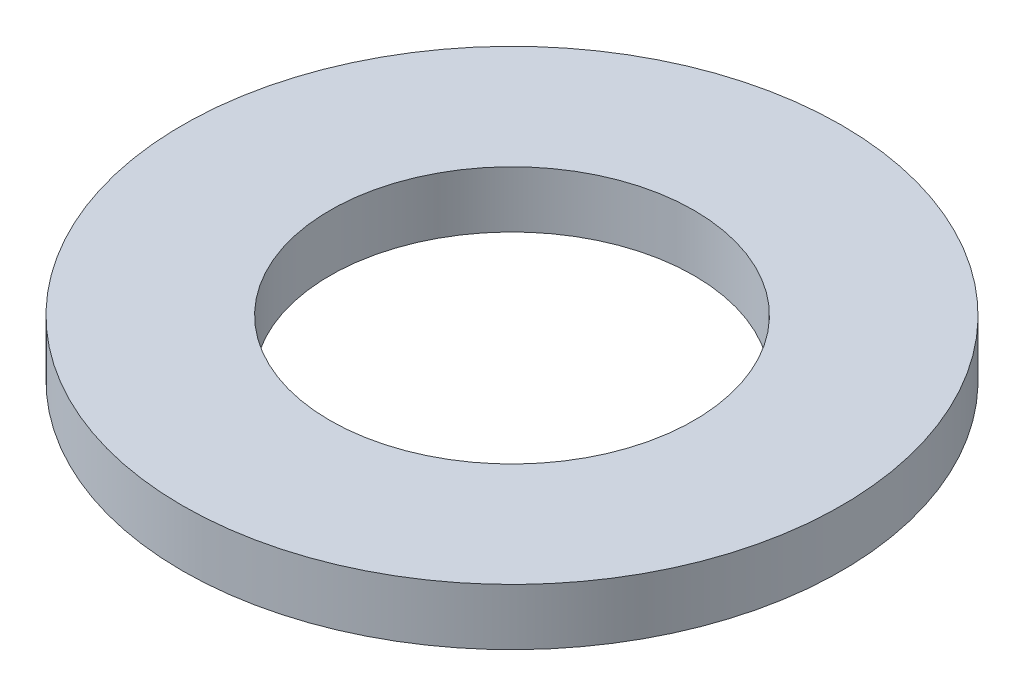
from build123d import *

# Parameters (mm, degrees)
SKETCH1_R      = 52.5
SKETCH1_R_2    = 29
EXTRUDE1_DEPTH = 9


with BuildPart() as part:
    # Sketch1 → Extrude1 (new body)
    with BuildSketch(Plane(origin=(0, 0, 0), x_dir=(1, 0, 0), z_dir=(0, 1, 0))):
        with Locations(Location((0, 0, 0), (0, 0, 270))):
            Circle(SKETCH1_R)
        with Locations(Location((0, 0, 0), (0, 0, 270))):
            Circle(SKETCH1_R_2, mode=Mode.SUBTRACT)
    extrude(amount=EXTRUDE1_DEPTH)


solid = part.part
